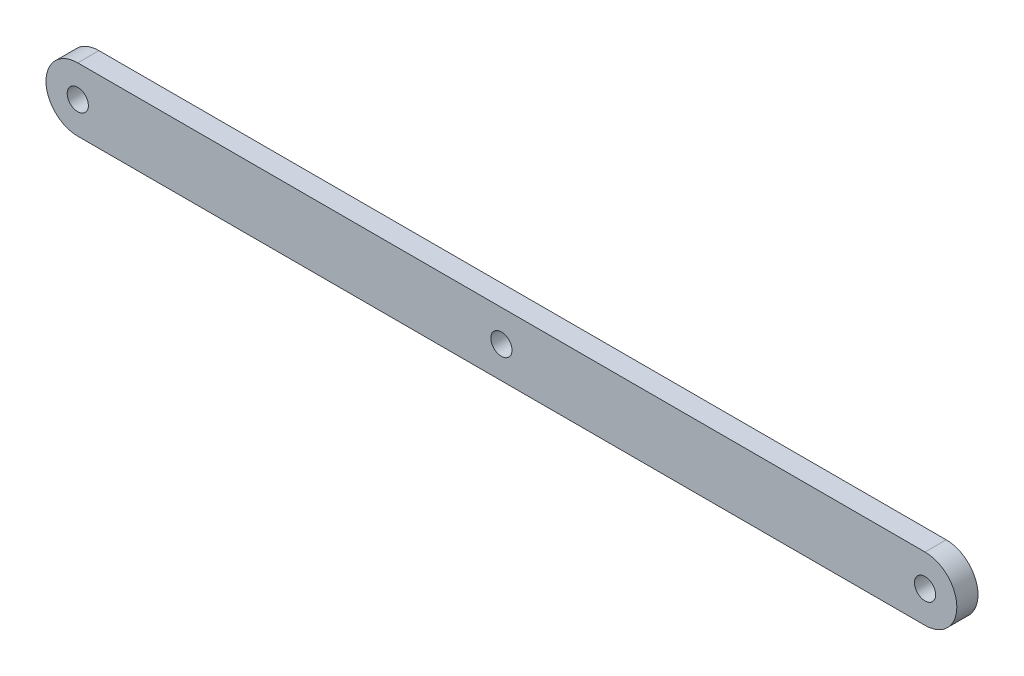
from build123d import *

# Parameters (mm, degrees)
EXTRUDE1_DEPTH     = 12.7
SKETCH6_R          = 6.35
CUT_EXTRUDE4_DEPTH = 529.5779058
SKETCH7_R          = 6.35
CUT_EXTRUDE5_DEPTH = 529.5779058


with BuildPart() as part:
    # Sketch1 → Extrude1 (new body)
    with BuildSketch(Plane.XY):
        with BuildLine():
            Line((0, 0), (508, 0))
            ThreePointArc((508, 0), (527.05, 19.05), (508, 38.1))
            Line((508, 38.1), (0, 38.1))
            ThreePointArc((0, 38.1), (-19.05, 19.05), (0, 0))
        make_face()
    extrude(amount=EXTRUDE1_DEPTH)

    # Sketch6 → Cut-Extrude4 (cut, through all)
    with BuildSketch(Plane.XY.offset(12.7)):
        with Locations((0, 19.05)):
            Circle(SKETCH6_R)
    cut_extrude4 = extrude(amount=-CUT_EXTRUDE4_DEPTH, mode=Mode.SUBTRACT)

    # Mirror1: Cut-Extrude4 across plane
    add(cut_extrude4.mirror(Plane(origin=(254, 0, 0), x_dir=(0, 0, 1), z_dir=(1, 0, 0))), mode=Mode.SUBTRACT)

    # Sketch7 → Cut-Extrude5 (cut, through all)
    with BuildSketch(Plane.XY.offset(12.7)):
        with Locations((254, 19.05)):
            Circle(SKETCH7_R)
    extrude(amount=-CUT_EXTRUDE5_DEPTH, mode=Mode.SUBTRACT)


solid = part.part
